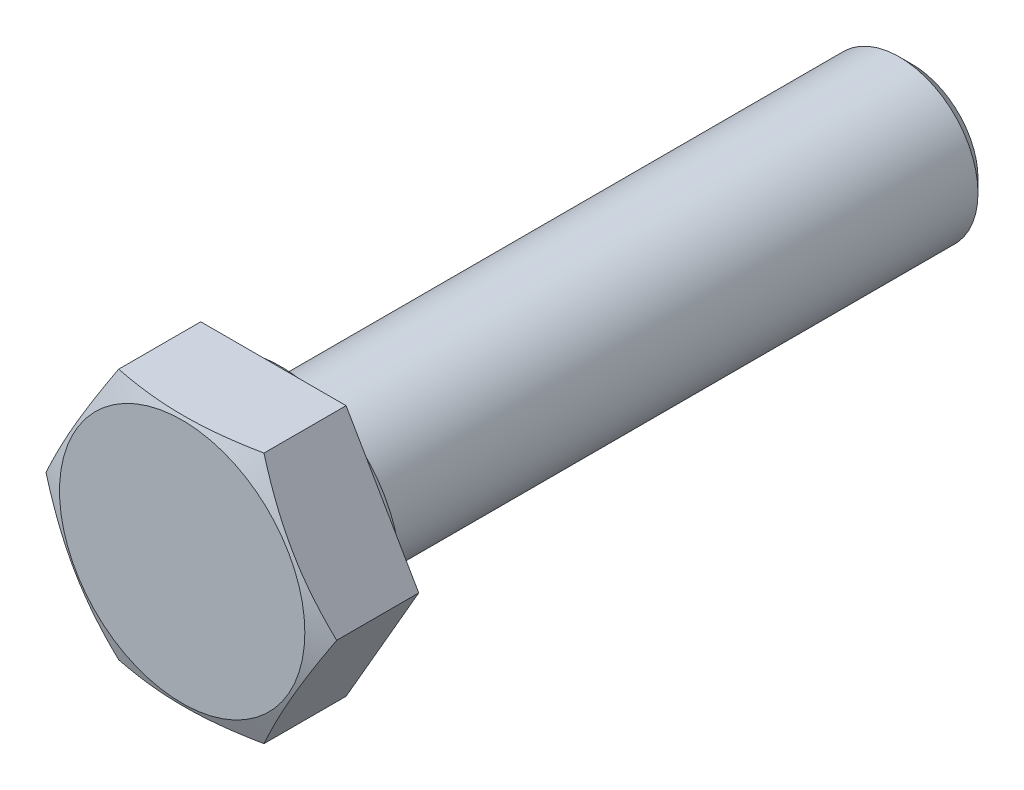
ISO-10303-21;
HEADER;
FILE_DESCRIPTION(('STEP AP214'),'2;1');
FILE_NAME('part.step','',(''),(''),'','','');
FILE_SCHEMA(('AUTOMOTIVE_DESIGN { 1 0 10303 214 1 1 1 1 }'));
ENDSEC;
DATA;
#1=APPLICATION_CONTEXT('core data for automotive mechanical design processes');
#2=APPLICATION_PROTOCOL_DEFINITION('international standard','automotive_design',2000,#1);
#3=PRODUCT_CONTEXT('',#1,'mechanical');
#4=PRODUCT('Part','Part','',(#3));
#5=PRODUCT_RELATED_PRODUCT_CATEGORY('part','',(#4));
#6=PRODUCT_DEFINITION_FORMATION('','',#4);
#7=PRODUCT_DEFINITION_CONTEXT('part definition',#1,'design');
#8=PRODUCT_DEFINITION('design','',#6,#7);
#9=PRODUCT_DEFINITION_SHAPE('','',#8);
#10=(LENGTH_UNIT() NAMED_UNIT(*) SI_UNIT(.MILLI.,.METRE.));
#11=(NAMED_UNIT(*) PLANE_ANGLE_UNIT() SI_UNIT($,.RADIAN.));
#12=(NAMED_UNIT(*) SI_UNIT($,.STERADIAN.) SOLID_ANGLE_UNIT());
#13=UNCERTAINTY_MEASURE_WITH_UNIT(LENGTH_MEASURE(1.E-05),#10,'distance_accuracy_value','');
#14=(GEOMETRIC_REPRESENTATION_CONTEXT(3) GLOBAL_UNCERTAINTY_ASSIGNED_CONTEXT((#13)) GLOBAL_UNIT_ASSIGNED_CONTEXT((#10,
#11,#12)) REPRESENTATION_CONTEXT('',''));
#15=CARTESIAN_POINT('',(0.,0.,0.));
#16=DIRECTION('',(0.,0.,1.));
#17=DIRECTION('',(1.,0.,0.));
#18=AXIS2_PLACEMENT_3D('',#15,#16,#17);
#19=CARTESIAN_POINT('',(0.,7.835,0.6));
#20=DIRECTION('',(0.,0.,1.));
#21=DIRECTION('',(1.,0.,0.));
#22=AXIS2_PLACEMENT_3D('',#19,#20,#21);
#23=PLANE('',#22);
#24=CARTESIAN_POINT('',(0.,0.,0.6));
#25=DIRECTION('',(0.,0.,1.));
#26=DIRECTION('',(1.,0.,0.));
#27=AXIS2_PLACEMENT_3D('',#24,#25,#26);
#28=CIRCLE('',#27,7.835);
#29=CARTESIAN_POINT('',(7.835,0.,0.6));
#30=VERTEX_POINT('',#29);
#31=EDGE_CURVE('E229',#30,#30,#28,.T.);
#32=ORIENTED_EDGE('',*,*,#31,.T.);
#33=EDGE_LOOP('',(#32));
#34=FACE_BOUND('',#33,.T.);
#35=DIRECTION('',(-1.,0.,0.));
#36=VECTOR('',#35,1.);
#37=CARTESIAN_POINT('',(0.,-7.99999626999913,0.6));
#38=LINE('',#37,#36);
#39=CARTESIAN_POINT('',(4.6188,-7.99999626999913,0.6));
#40=VERTEX_POINT('',#39);
#41=CARTESIAN_POINT('',(-4.6188,-7.99999626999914,0.6));
#42=VERTEX_POINT('',#41);
#43=EDGE_CURVE('E215',#40,#42,#38,.T.);
#44=ORIENTED_EDGE('',*,*,#43,.T.);
#45=DIRECTION('',(-0.5,0.866025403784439,0.));
#46=VECTOR('',#45,1.);
#47=CARTESIAN_POINT('',(-10.3208545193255,1.87625186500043,0.6));
#48=LINE('',#47,#46);
#49=CARTESIAN_POINT('',(-9.2376,0.,0.6));
#50=VERTEX_POINT('',#49);
#51=EDGE_CURVE('E84',#42,#50,#48,.T.);
#52=ORIENTED_EDGE('',*,*,#51,.T.);
#53=DIRECTION('',(0.5,0.866025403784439,0.));
#54=VECTOR('',#53,1.);
#55=CARTESIAN_POINT('',(-3.53554548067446,9.87624813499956,0.6));
#56=LINE('',#55,#54);
#57=CARTESIAN_POINT('',(-4.6188,7.99999626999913,0.6));
#58=VERTEX_POINT('',#57);
#59=EDGE_CURVE('E223',#50,#58,#56,.T.);
#60=ORIENTED_EDGE('',*,*,#59,.T.);
#61=DIRECTION('',(1.,0.,0.));
#62=VECTOR('',#61,1.);
#63=CARTESIAN_POINT('',(0.,7.99999626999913,0.6));
#64=LINE('',#63,#62);
#65=CARTESIAN_POINT('',(4.6188,7.99999626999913,0.6));
#66=VERTEX_POINT('',#65);
#67=EDGE_CURVE('E220',#58,#66,#64,.T.);
#68=ORIENTED_EDGE('',*,*,#67,.T.);
#69=DIRECTION('',(0.5,-0.866025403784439,0.));
#70=VECTOR('',#69,1.);
#71=CARTESIAN_POINT('',(3.53554548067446,9.87624813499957,0.6));
#72=LINE('',#71,#70);
#73=CARTESIAN_POINT('',(9.2376,0.,0.6));
#74=VERTEX_POINT('',#73);
#75=EDGE_CURVE('E218',#66,#74,#72,.T.);
#76=ORIENTED_EDGE('',*,*,#75,.T.);
#77=DIRECTION('',(-0.5,-0.866025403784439,0.));
#78=VECTOR('',#77,1.);
#79=CARTESIAN_POINT('',(10.3208545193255,1.87625186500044,0.6));
#80=LINE('',#79,#78);
#81=EDGE_CURVE('E203',#74,#40,#80,.T.);
#82=ORIENTED_EDGE('',*,*,#81,.T.);
#83=EDGE_LOOP('',(#44,#52,#60,#68,#76,#82));
#84=FACE_BOUND('',#83,.T.);
#85=ADVANCED_FACE('F17',(#34,#84),#23,.F.);
#86=CARTESIAN_POINT('',(0.,0.,-40.));
#87=DIRECTION('',(0.,0.,1.));
#88=DIRECTION('',(1.,0.,0.));
#89=AXIS2_PLACEMENT_3D('',#86,#87,#88);
#90=PLANE('',#89);
#91=CARTESIAN_POINT('',(0.,0.,-40.));
#92=DIRECTION('',(0.,0.,1.));
#93=DIRECTION('',(1.,0.,0.));
#94=AXIS2_PLACEMENT_3D('',#91,#92,#93);
#95=CIRCLE('',#94,4.188125);
#96=CARTESIAN_POINT('',(4.188125,0.,-40.));
#97=VERTEX_POINT('',#96);
#98=EDGE_CURVE('E77',#97,#97,#95,.T.);
#99=ORIENTED_EDGE('',*,*,#98,.F.);
#100=EDGE_LOOP('',(#99));
#101=FACE_BOUND('',#100,.T.);
#102=ADVANCED_FACE('F19',(#101),#90,.F.);
#103=CARTESIAN_POINT('',(0.,0.,-40.));
#104=DIRECTION('',(0.,0.,1.));
#105=DIRECTION('',(1.,0.,0.));
#106=AXIS2_PLACEMENT_3D('',#103,#104,#105);
#107=CONICAL_SURFACE('',#106,4.188125,0.785398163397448);
#108=CARTESIAN_POINT('',(0.,0.,-39.188125));
#109=DIRECTION('',(0.,0.,1.));
#110=DIRECTION('',(1.,0.,0.));
#111=AXIS2_PLACEMENT_3D('',#108,#109,#110);
#112=CIRCLE('',#111,5.);
#113=CARTESIAN_POINT('',(5.,0.,-39.188125));
#114=VERTEX_POINT('',#113);
#115=EDGE_CURVE('E173',#114,#114,#112,.T.);
#116=ORIENTED_EDGE('',*,*,#115,.F.);
#117=EDGE_LOOP('',(#116));
#118=FACE_BOUND('',#117,.T.);
#119=ORIENTED_EDGE('',*,*,#98,.T.);
#120=EDGE_LOOP('',(#119));
#121=FACE_BOUND('',#120,.T.);
#122=ADVANCED_FACE('F135',(#118,#121),#107,.T.);
#123=CARTESIAN_POINT('',(0.,0.,6.4));
#124=DIRECTION('',(0.,0.,1.));
#125=DIRECTION('',(1.,0.,0.));
#126=AXIS2_PLACEMENT_3D('',#123,#124,#125);
#127=CYLINDRICAL_SURFACE('',#126,5.);
#128=CARTESIAN_POINT('',(0.,0.,-1.5));
#129=DIRECTION('',(0.,0.,1.));
#130=DIRECTION('',(1.,0.,0.));
#131=AXIS2_PLACEMENT_3D('',#128,#129,#130);
#132=CIRCLE('',#131,5.);
#133=CARTESIAN_POINT('',(5.,0.,-1.5));
#134=VERTEX_POINT('',#133);
#135=EDGE_CURVE('E177',#134,#134,#132,.T.);
#136=ORIENTED_EDGE('',*,*,#135,.F.);
#137=EDGE_LOOP('',(#136));
#138=FACE_BOUND('',#137,.T.);
#139=ORIENTED_EDGE('',*,*,#115,.T.);
#140=EDGE_LOOP('',(#139));
#141=FACE_BOUND('',#140,.T.);
#142=ADVANCED_FACE('F162',(#138,#141),#127,.T.);
#143=CARTESIAN_POINT('',(0.,5.,-1.5));
#144=DIRECTION('',(0.,0.,-1.));
#145=DIRECTION('',(-1.,0.,0.));
#146=AXIS2_PLACEMENT_3D('',#143,#144,#145);
#147=PLANE('',#146);
#148=CARTESIAN_POINT('',(0.,0.,-1.5));
#149=DIRECTION('',(0.,0.,1.));
#150=DIRECTION('',(1.,0.,0.));
#151=AXIS2_PLACEMENT_3D('',#148,#149,#150);
#152=CIRCLE('',#151,4.188125);
#153=CARTESIAN_POINT('',(4.188125,0.,-1.5));
#154=VERTEX_POINT('',#153);
#155=EDGE_CURVE('E243',#154,#154,#152,.T.);
#156=ORIENTED_EDGE('',*,*,#155,.F.);
#157=EDGE_LOOP('',(#156));
#158=FACE_BOUND('',#157,.T.);
#159=ORIENTED_EDGE('',*,*,#135,.T.);
#160=EDGE_LOOP('',(#159));
#161=FACE_BOUND('',#160,.T.);
#162=ADVANCED_FACE('F158',(#158,#161),#147,.F.);
#163=CARTESIAN_POINT('',(0.,0.,-1.5));
#164=DIRECTION('',(0.,0.,1.));
#165=DIRECTION('',(1.,0.,0.));
#166=AXIS2_PLACEMENT_3D('',#163,#164,#165);
#167=CONICAL_SURFACE('',#166,4.188125,1.0471975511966);
#168=CARTESIAN_POINT('',(0.,0.,-1.03126375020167));
#169=DIRECTION('',(0.,0.,1.));
#170=DIRECTION('',(1.,0.,0.));
#171=AXIS2_PLACEMENT_3D('',#168,#169,#170);
#172=CIRCLE('',#171,5.);
#173=CARTESIAN_POINT('',(5.,0.,-1.03126375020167));
#174=VERTEX_POINT('',#173);
#175=EDGE_CURVE('E240',#174,#174,#172,.T.);
#176=ORIENTED_EDGE('',*,*,#175,.F.);
#177=EDGE_LOOP('',(#176));
#178=FACE_BOUND('',#177,.T.);
#179=ORIENTED_EDGE('',*,*,#155,.T.);
#180=EDGE_LOOP('',(#179));
#181=FACE_BOUND('',#180,.T.);
#182=ADVANCED_FACE('F154',(#178,#181),#167,.T.);
#183=CARTESIAN_POINT('',(0.,0.,6.4));
#184=DIRECTION('',(0.,0.,1.));
#185=DIRECTION('',(1.,0.,0.));
#186=AXIS2_PLACEMENT_3D('',#183,#184,#185);
#187=CYLINDRICAL_SURFACE('',#186,5.);
#188=CARTESIAN_POINT('',(0.,0.,-0.5));
#189=DIRECTION('',(0.,0.,1.));
#190=DIRECTION('',(1.,0.,0.));
#191=AXIS2_PLACEMENT_3D('',#188,#189,#190);
#192=CIRCLE('',#191,5.);
#193=CARTESIAN_POINT('',(5.,0.,-0.5));
#194=VERTEX_POINT('',#193);
#195=EDGE_CURVE('E237',#194,#194,#192,.T.);
#196=ORIENTED_EDGE('',*,*,#195,.F.);
#197=EDGE_LOOP('',(#196));
#198=FACE_BOUND('',#197,.T.);
#199=ORIENTED_EDGE('',*,*,#175,.T.);
#200=EDGE_LOOP('',(#199));
#201=FACE_BOUND('',#200,.T.);
#202=ADVANCED_FACE('F150',(#198,#201),#187,.T.);
#203=CARTESIAN_POINT('',(0.,0.,-0.5));
#204=DIRECTION('',(0.,0.,1.));
#205=DIRECTION('',(1.,0.,0.));
#206=AXIS2_PLACEMENT_3D('',#203,#204,#205);
#207=TOROIDAL_SURFACE('',#206,5.5,0.5);
#208=ORIENTED_EDGE('',*,*,#195,.T.);
#209=EDGE_LOOP('',(#208));
#210=FACE_BOUND('',#209,.T.);
#211=CARTESIAN_POINT('',(0.,0.,0.));
#212=DIRECTION('',(0.,0.,1.));
#213=DIRECTION('',(1.,0.,0.));
#214=AXIS2_PLACEMENT_3D('',#211,#212,#213);
#215=CIRCLE('',#214,5.5);
#216=CARTESIAN_POINT('',(5.5,0.,0.));
#217=VERTEX_POINT('',#216);
#218=EDGE_CURVE('E234',#217,#217,#215,.T.);
#219=ORIENTED_EDGE('',*,*,#218,.F.);
#220=EDGE_LOOP('',(#219));
#221=FACE_BOUND('',#220,.T.);
#222=ADVANCED_FACE('F146',(#210,#221),#207,.F.);
#223=CARTESIAN_POINT('',(0.,5.5,0.));
#224=DIRECTION('',(0.,0.,1.));
#225=DIRECTION('',(1.,0.,0.));
#226=AXIS2_PLACEMENT_3D('',#223,#224,#225);
#227=PLANE('',#226);
#228=CARTESIAN_POINT('',(0.,0.,0.));
#229=DIRECTION('',(0.,0.,1.));
#230=DIRECTION('',(1.,0.,0.));
#231=AXIS2_PLACEMENT_3D('',#228,#229,#230);
#232=CIRCLE('',#231,7.235);
#233=CARTESIAN_POINT('',(7.235,0.,0.));
#234=VERTEX_POINT('',#233);
#235=EDGE_CURVE('E231',#234,#234,#232,.T.);
#236=ORIENTED_EDGE('',*,*,#235,.F.);
#237=EDGE_LOOP('',(#236));
#238=FACE_BOUND('',#237,.T.);
#239=ORIENTED_EDGE('',*,*,#218,.T.);
#240=EDGE_LOOP('',(#239));
#241=FACE_BOUND('',#240,.T.);
#242=ADVANCED_FACE('F142',(#238,#241),#227,.F.);
#243=CARTESIAN_POINT('',(0.,0.,0.6));
#244=DIRECTION('',(0.,0.,1.));
#245=DIRECTION('',(1.,0.,0.));
#246=AXIS2_PLACEMENT_3D('',#243,#244,#245);
#247=TOROIDAL_SURFACE('',#246,7.235,0.6);
#248=ORIENTED_EDGE('',*,*,#31,.F.);
#249=EDGE_LOOP('',(#248));
#250=FACE_BOUND('',#249,.T.);
#251=ORIENTED_EDGE('',*,*,#235,.T.);
#252=EDGE_LOOP('',(#251));
#253=FACE_BOUND('',#252,.T.);
#254=ADVANCED_FACE('F117',(#250,#253),#247,.T.);
#255=CARTESIAN_POINT('',(-4.6188,-7.99999626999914,-40.));
#256=DIRECTION('',(0.866025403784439,0.5,0.));
#257=DIRECTION('',(0.5,-0.866025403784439,0.));
#258=AXIS2_PLACEMENT_3D('',#255,#256,#257);
#259=PLANE('',#258);
#260=ORIENTED_EDGE('',*,*,#51,.F.);
#261=DIRECTION('',(0.,0.,1.));
#262=VECTOR('',#261,1.);
#263=CARTESIAN_POINT('',(-4.6188,-7.99999626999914,-40.));
#264=LINE('',#263,#262);
#265=CARTESIAN_POINT('',(-4.6188,-7.99999626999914,5.81818181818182));
#266=VERTEX_POINT('',#265);
#267=EDGE_CURVE('E37',#42,#266,#264,.T.);
#268=ORIENTED_EDGE('',*,*,#267,.T.);
#269=CARTESIAN_POINT('',(-9.23760011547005,2.00000000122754E-07,5.81818177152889));
#270=CARTESIAN_POINT('',(-9.07623171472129,-0.27949806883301,5.88338258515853));
#271=CARTESIAN_POINT('',(-8.91433070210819,-0.559918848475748,5.94367122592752));
#272=CARTESIAN_POINT('',(-8.58945812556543,-1.12261465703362,6.0525711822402));
#273=CARTESIAN_POINT('',(-8.42648599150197,-1.40489067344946,6.10117565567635));
#274=CARTESIAN_POINT('',(-8.09970314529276,-1.97089516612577,6.184761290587));
#275=CARTESIAN_POINT('',(-7.93589269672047,-2.25462318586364,6.21974649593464));
#276=CARTESIAN_POINT('',(-7.60766331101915,-2.82313315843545,6.27447232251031));
#277=CARTESIAN_POINT('',(-7.44324451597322,-3.10791486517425,6.2942163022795));
#278=CARTESIAN_POINT('',(-7.11690996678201,-3.67314288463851,6.31723187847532));
#279=CARTESIAN_POINT('',(-6.95499911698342,-3.95358070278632,6.3207774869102));
#280=CARTESIAN_POINT('',(-6.63127309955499,-4.51429061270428,6.31195075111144));
#281=CARTESIAN_POINT('',(-6.46945794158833,-4.79456268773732,6.29957700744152));
#282=CARTESIAN_POINT('',(-6.14641204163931,-5.35409459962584,6.25957675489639));
#283=CARTESIAN_POINT('',(-5.98518099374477,-5.63335496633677,6.23195993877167));
#284=CARTESIAN_POINT('',(-5.66348869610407,-6.190542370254,6.16281191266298));
#285=CARTESIAN_POINT('',(-5.50302737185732,-6.46846953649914,6.12128207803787));
#286=CARTESIAN_POINT('',(-5.28250881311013,-6.85041888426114,6.05563542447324));
#287=CARTESIAN_POINT('',(-5.22204978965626,-6.95513698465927,6.03674445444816));
#288=CARTESIAN_POINT('',(-5.1012744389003,-7.16432602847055,5.99731748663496));
#289=CARTESIAN_POINT('',(-5.04095809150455,-7.26879700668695,5.9767817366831));
#290=CARTESIAN_POINT('',(-4.920256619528,-7.4778580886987,5.93408711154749));
#291=CARTESIAN_POINT('',(-4.85987196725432,-7.58244737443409,5.91192291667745));
#292=CARTESIAN_POINT('',(-4.73923496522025,-7.79139679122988,5.86612783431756));
#293=CARTESIAN_POINT('',(-4.67898263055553,-7.89575689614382,5.84249678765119));
#294=CARTESIAN_POINT('',(-4.61879988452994,-7.99999646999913,5.81818177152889));
#295=B_SPLINE_CURVE_WITH_KNOTS('',3,(#269,#270,#271,#272,#273,#274,#275,#276,#277,#278,#279,
#280,#281,#282,#283,#284,#285,#286,#287,#288,#289,#290,#291,#292,#293,#294),.UNSPECIFIED.,.F.,
.F.,(4,2,2,2,2,2,2,2,2,2,2,2,4),(0.,0.987840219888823,1.97625750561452,2.96438108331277,
3.95228685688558,4.92341776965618,5.89463405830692,6.86523348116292,7.83573698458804,
8.20288448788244,8.56997677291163,8.93832669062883,9.3067166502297),.UNSPECIFIED.);
#296=CARTESIAN_POINT('',(-9.2376,0.,5.81818181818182));
#297=VERTEX_POINT('',#296);
#298=EDGE_CURVE('E11',#297,#266,#295,.T.);
#299=ORIENTED_EDGE('',*,*,#298,.F.);
#300=DIRECTION('',(0.,0.,1.));
#301=VECTOR('',#300,1.);
#302=CARTESIAN_POINT('',(-9.2376,0.,-40.));
#303=LINE('',#302,#301);
#304=EDGE_CURVE('E213',#50,#297,#303,.T.);
#305=ORIENTED_EDGE('',*,*,#304,.F.);
#306=EDGE_LOOP('',(#260,#268,#299,#305));
#307=FACE_BOUND('',#306,.T.);
#308=ADVANCED_FACE('F80',(#307),#259,.F.);
#309=CARTESIAN_POINT('',(-9.2376,0.,-40.));
#310=DIRECTION('',(0.866025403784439,-0.5,0.));
#311=DIRECTION('',(-0.5,-0.866025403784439,0.));
#312=AXIS2_PLACEMENT_3D('',#309,#310,#311);
#313=PLANE('',#312);
#314=ORIENTED_EDGE('',*,*,#59,.F.);
#315=ORIENTED_EDGE('',*,*,#304,.T.);
#316=CARTESIAN_POINT('',(-4.61879988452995,7.99999646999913,5.81818177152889));
#317=CARTESIAN_POINT('',(-4.78016828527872,7.72049820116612,5.88338258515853));
#318=CARTESIAN_POINT('',(-4.94206929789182,7.44007742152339,5.94367122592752));
#319=CARTESIAN_POINT('',(-5.26694187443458,6.87738161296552,6.0525711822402));
#320=CARTESIAN_POINT('',(-5.42991400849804,6.59510559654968,6.10117565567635));
#321=CARTESIAN_POINT('',(-5.75669685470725,6.02910110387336,6.184761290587));
#322=CARTESIAN_POINT('',(-5.92050730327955,5.7453730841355,6.21974649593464));
#323=CARTESIAN_POINT('',(-6.24873668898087,5.17686311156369,6.27447232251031));
#324=CARTESIAN_POINT('',(-6.41315548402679,4.89208140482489,6.2942163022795));
#325=CARTESIAN_POINT('',(-6.739490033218,4.32685338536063,6.31723187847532));
#326=CARTESIAN_POINT('',(-6.90140088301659,4.04641556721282,6.3207774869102));
#327=CARTESIAN_POINT('',(-7.22512690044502,3.48570565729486,6.31195075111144));
#328=CARTESIAN_POINT('',(-7.38694205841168,3.20543358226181,6.29957700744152));
#329=CARTESIAN_POINT('',(-7.7099879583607,2.6459016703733,6.25957675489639));
#330=CARTESIAN_POINT('',(-7.87121900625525,2.36664130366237,6.23195993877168));
#331=CARTESIAN_POINT('',(-8.19291130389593,1.80945389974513,6.16281191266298));
#332=CARTESIAN_POINT('',(-8.35337262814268,1.53152673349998,6.12128207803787));
#333=CARTESIAN_POINT('',(-8.57389118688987,1.14957738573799,6.05563542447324));
#334=CARTESIAN_POINT('',(-8.63435021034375,1.04485928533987,6.03674445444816));
#335=CARTESIAN_POINT('',(-8.75512556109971,0.835670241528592,5.99731748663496));
#336=CARTESIAN_POINT('',(-8.81544190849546,0.731199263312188,5.97678173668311));
#337=CARTESIAN_POINT('',(-8.93614338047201,0.522138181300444,5.93408711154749));
#338=CARTESIAN_POINT('',(-8.99652803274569,0.417548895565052,5.91192291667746));
#339=CARTESIAN_POINT('',(-9.11716503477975,0.208599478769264,5.86612783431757));
#340=CARTESIAN_POINT('',(-9.17741736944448,0.104239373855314,5.84249678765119));
#341=CARTESIAN_POINT('',(-9.23760011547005,-2.0000000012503E-07,5.81818177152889));
#342=B_SPLINE_CURVE_WITH_KNOTS('',3,(#316,#317,#318,#319,#320,#321,#322,#323,#324,#325,#326,
#327,#328,#329,#330,#331,#332,#333,#334,#335,#336,#337,#338,#339,#340,#341),.UNSPECIFIED.,.F.,
.F.,(4,2,2,2,2,2,2,2,2,2,2,2,4),(0.,0.987840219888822,1.97625750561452,2.96438108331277,
3.95228685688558,4.92341776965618,5.89463405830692,6.86523348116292,7.83573698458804,
8.20288448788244,8.56997677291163,8.93832669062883,9.3067166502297),.UNSPECIFIED.);
#343=CARTESIAN_POINT('',(-4.6188,7.99999626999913,5.81818181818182));
#344=VERTEX_POINT('',#343);
#345=EDGE_CURVE('E30',#344,#297,#342,.T.);
#346=ORIENTED_EDGE('',*,*,#345,.F.);
#347=DIRECTION('',(0.,0.,1.));
#348=VECTOR('',#347,1.);
#349=CARTESIAN_POINT('',(-4.6188,7.99999626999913,-40.));
#350=LINE('',#349,#348);
#351=EDGE_CURVE('E208',#58,#344,#350,.T.);
#352=ORIENTED_EDGE('',*,*,#351,.F.);
#353=EDGE_LOOP('',(#314,#315,#346,#352));
#354=FACE_BOUND('',#353,.T.);
#355=ADVANCED_FACE('F109',(#354),#313,.F.);
#356=CARTESIAN_POINT('',(-4.6188,7.99999626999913,-40.));
#357=DIRECTION('',(0.,-1.,0.));
#358=DIRECTION('',(-1.,0.,0.));
#359=AXIS2_PLACEMENT_3D('',#356,#357,#358);
#360=PLANE('',#359);
#361=ORIENTED_EDGE('',*,*,#67,.F.);
#362=ORIENTED_EDGE('',*,*,#351,.T.);
#363=CARTESIAN_POINT('',(-12.5719547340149,7.99999626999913,3.52982738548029));
#364=CARTESIAN_POINT('',(-12.1983187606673,7.99999626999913,3.65714990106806));
#365=CARTESIAN_POINT('',(-11.8241969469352,7.99999626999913,3.78307295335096));
#366=CARTESIAN_POINT('',(-11.0747197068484,7.99999626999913,4.03131289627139));
#367=CARTESIAN_POINT('',(-10.6993641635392,7.99999626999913,4.15362943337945));
#368=CARTESIAN_POINT('',(-9.94620503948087,7.99999626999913,4.39415137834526));
#369=CARTESIAN_POINT('',(-9.56839757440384,7.99999626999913,4.51234466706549));
#370=CARTESIAN_POINT('',(-8.81107863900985,7.99999626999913,4.74312776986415));
#371=CARTESIAN_POINT('',(-8.43156721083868,7.99999626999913,4.85571772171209));
#372=CARTESIAN_POINT('',(-7.67246142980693,7.99999626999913,5.07327543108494));
#373=CARTESIAN_POINT('',(-7.29287748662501,7.99999626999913,5.17827932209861));
#374=CARTESIAN_POINT('',(-6.53133965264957,7.99999626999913,5.37943691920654));
#375=CARTESIAN_POINT('',(-6.14938567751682,7.99999626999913,5.47559030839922));
#376=CARTESIAN_POINT('',(-5.38308686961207,7.99999626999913,5.65661961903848));
#377=CARTESIAN_POINT('',(-4.99874399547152,7.99999626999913,5.74150375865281));
#378=CARTESIAN_POINT('',(-4.22720948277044,7.99999626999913,5.89721151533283));
#379=CARTESIAN_POINT('',(-3.84001810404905,7.99999626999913,5.96803639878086));
#380=CARTESIAN_POINT('',(-3.15468340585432,7.99999626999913,6.07772100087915));
#381=CARTESIAN_POINT('',(-2.85711851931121,7.99999626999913,6.12017938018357));
#382=CARTESIAN_POINT('',(-2.26056309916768,7.99999626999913,6.19360511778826));
#383=CARTESIAN_POINT('',(-1.9615726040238,7.99999626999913,6.22457278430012));
#384=CARTESIAN_POINT('',(-1.36269467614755,7.99999626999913,6.27378877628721));
#385=CARTESIAN_POINT('',(-1.06280781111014,7.99999626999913,6.29204392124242));
#386=CARTESIAN_POINT('',(-0.462511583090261,7.99999626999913,6.31505964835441));
#387=CARTESIAN_POINT('',(-0.162102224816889,7.99999626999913,6.31982035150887));
#388=CARTESIAN_POINT('',(0.43871841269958,7.99999626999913,6.31562600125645));
#389=CARTESIAN_POINT('',(0.739129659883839,7.99999626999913,6.30666642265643));
#390=CARTESIAN_POINT('',(1.33925291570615,7.99999626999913,6.27543464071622));
#391=CARTESIAN_POINT('',(1.63896491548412,7.99999626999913,6.25316226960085));
#392=CARTESIAN_POINT('',(2.23737206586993,7.99999626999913,6.19623962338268));
#393=CARTESIAN_POINT('',(2.53606652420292,7.99999626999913,6.16158216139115));
#394=CARTESIAN_POINT('',(3.13194924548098,7.99999626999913,6.08119272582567));
#395=CARTESIAN_POINT('',(3.42913747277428,7.99999626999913,6.03546049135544));
#396=CARTESIAN_POINT('',(4.11363187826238,7.99999626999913,5.91871471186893));
#397=CARTESIAN_POINT('',(4.50034816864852,7.99999626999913,5.84425774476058));
#398=CARTESIAN_POINT('',(5.27095740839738,7.99999626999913,5.68198807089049));
#399=CARTESIAN_POINT('',(5.65485012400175,7.99999626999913,5.59417427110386));
#400=CARTESIAN_POINT('',(6.42025470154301,7.99999626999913,5.40788960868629));
#401=CARTESIAN_POINT('',(6.80176506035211,7.99999626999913,5.30941262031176));
#402=CARTESIAN_POINT('',(7.56249587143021,7.99999626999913,5.10408437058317));
#403=CARTESIAN_POINT('',(7.94171640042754,7.99999626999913,4.99723339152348));
#404=CARTESIAN_POINT('',(8.69926332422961,7.99999626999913,4.77660865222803));
#405=CARTESIAN_POINT('',(9.07758437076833,7.99999626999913,4.66281661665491));
#406=CARTESIAN_POINT('',(9.83259783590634,7.99999626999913,4.42994140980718));
#407=CARTESIAN_POINT('',(10.2092902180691,7.99999626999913,4.31085812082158));
#408=CARTESIAN_POINT('',(10.9604179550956,7.99999626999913,4.06875367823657));
#409=CARTESIAN_POINT('',(11.3348565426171,7.99999626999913,3.94574252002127));
#410=CARTESIAN_POINT('',(12.0825558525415,7.99999626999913,3.69629462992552));
#411=CARTESIAN_POINT('',(12.4558166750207,7.99999626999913,3.56985819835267));
#412=CARTESIAN_POINT('',(12.8286123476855,7.99999626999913,3.44208796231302));
#413=B_SPLINE_CURVE_WITH_KNOTS('',3,(#363,#364,#365,#366,#367,#368,#369,#370,#371,#372,#373,
#374,#375,#376,#377,#378,#379,#380,#381,#382,#383,#384,#385,#386,#387,#388,#389,#390,#391,#392,
#393,#394,#395,#396,#397,#398,#399,#400,#401,#402,#403,#404,#405,#406,#407,#408,#409,#410,#411,
#412),.UNSPECIFIED.,.F.,.F.,(4,2,2,2,2,2,2,2,2,2,2,2,2,2,2,2,2,2,2,2,2,2,2,2,4),(0.,
1.18421166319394,2.36853902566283,3.55609567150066,4.74362310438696,5.92505950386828,
7.10653818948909,8.28715048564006,9.46765639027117,10.3692009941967,11.2707214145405,
12.1717578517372,13.0727862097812,13.9741118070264,14.8754487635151,15.777309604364,
16.6791916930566,17.8603375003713,19.0415800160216,20.2235047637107,21.4053896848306,
22.5905333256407,23.7757033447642,24.9580661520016,26.1403256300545),.UNSPECIFIED.);
#414=CARTESIAN_POINT('',(4.6188,7.99999626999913,5.81818181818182));
#415=VERTEX_POINT('',#414);
#416=EDGE_CURVE('E91',#415,#344,#413,.F.);
#417=ORIENTED_EDGE('',*,*,#416,.F.);
#418=DIRECTION('',(0.,0.,1.));
#419=VECTOR('',#418,1.);
#420=CARTESIAN_POINT('',(4.6188,7.99999626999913,-40.));
#421=LINE('',#420,#419);
#422=EDGE_CURVE('E205',#66,#415,#421,.T.);
#423=ORIENTED_EDGE('',*,*,#422,.F.);
#424=EDGE_LOOP('',(#361,#362,#417,#423));
#425=FACE_BOUND('',#424,.T.);
#426=ADVANCED_FACE('F112',(#425),#360,.F.);
#427=CARTESIAN_POINT('',(4.6188,7.99999626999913,-40.));
#428=DIRECTION('',(-0.866025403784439,-0.5,0.));
#429=DIRECTION('',(-0.5,0.866025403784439,0.));
#430=AXIS2_PLACEMENT_3D('',#427,#428,#429);
#431=PLANE('',#430);
#432=ORIENTED_EDGE('',*,*,#75,.F.);
#433=ORIENTED_EDGE('',*,*,#422,.T.);
#434=CARTESIAN_POINT('',(9.23760011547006,-2.00000002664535E-07,5.81818177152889));
#435=CARTESIAN_POINT('',(9.07623171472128,0.279498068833,5.88338258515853));
#436=CARTESIAN_POINT('',(8.91433070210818,0.559918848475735,5.94367122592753));
#437=CARTESIAN_POINT('',(8.58945812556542,1.12261465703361,6.0525711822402));
#438=CARTESIAN_POINT('',(8.42648599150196,1.40489067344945,6.10117565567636));
#439=CARTESIAN_POINT('',(8.09970314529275,1.97089516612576,6.18476129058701));
#440=CARTESIAN_POINT('',(7.93589269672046,2.25462318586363,6.21974649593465));
#441=CARTESIAN_POINT('',(7.60766331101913,2.82313315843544,6.27447232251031));
#442=CARTESIAN_POINT('',(7.44324451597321,3.10791486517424,6.29421630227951));
#443=CARTESIAN_POINT('',(7.116909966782,3.6731428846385,6.31723187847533));
#444=CARTESIAN_POINT('',(6.95499911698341,3.95358070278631,6.3207774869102));
#445=CARTESIAN_POINT('',(6.63127309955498,4.51429061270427,6.31195075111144));
#446=CARTESIAN_POINT('',(6.46945794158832,4.79456268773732,6.29957700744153));
#447=CARTESIAN_POINT('',(6.1464120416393,5.35409459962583,6.25957675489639));
#448=CARTESIAN_POINT('',(5.98518099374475,5.63335496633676,6.23195993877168));
#449=CARTESIAN_POINT('',(5.66348869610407,6.190542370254,6.16281191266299));
#450=CARTESIAN_POINT('',(5.50302737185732,6.46846953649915,6.12128207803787));
#451=CARTESIAN_POINT('',(5.28250881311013,6.85041888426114,6.05563542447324));
#452=CARTESIAN_POINT('',(5.22204978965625,6.95513698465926,6.03674445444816));
#453=CARTESIAN_POINT('',(5.10127443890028,7.16432602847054,5.99731748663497));
#454=CARTESIAN_POINT('',(5.04095809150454,7.26879700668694,5.97678173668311));
#455=CARTESIAN_POINT('',(4.92025661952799,7.47785808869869,5.93408711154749));
#456=CARTESIAN_POINT('',(4.85987196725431,7.58244737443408,5.91192291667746));
#457=CARTESIAN_POINT('',(4.73923496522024,7.79139679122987,5.86612783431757));
#458=CARTESIAN_POINT('',(4.67898263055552,7.89575689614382,5.8424967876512));
#459=CARTESIAN_POINT('',(4.61879988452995,7.99999646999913,5.81818177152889));
#460=B_SPLINE_CURVE_WITH_KNOTS('',3,(#434,#435,#436,#437,#438,#439,#440,#441,#442,#443,#444,
#445,#446,#447,#448,#449,#450,#451,#452,#453,#454,#455,#456,#457,#458,#459),.UNSPECIFIED.,.F.,
.F.,(4,2,2,2,2,2,2,2,2,2,2,2,4),(0.,0.987840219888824,1.97625750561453,2.96438108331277,
3.95228685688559,4.92341776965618,5.89463405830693,6.86523348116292,7.83573698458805,
8.20288448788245,8.56997677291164,8.93832669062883,9.30671665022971),.UNSPECIFIED.);
#461=CARTESIAN_POINT('',(9.2376,0.,5.81818181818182));
#462=VERTEX_POINT('',#461);
#463=EDGE_CURVE('E95',#462,#415,#460,.T.);
#464=ORIENTED_EDGE('',*,*,#463,.F.);
#465=DIRECTION('',(0.,0.,1.));
#466=VECTOR('',#465,1.);
#467=CARTESIAN_POINT('',(9.2376,0.,-40.));
#468=LINE('',#467,#466);
#469=EDGE_CURVE('E202',#74,#462,#468,.T.);
#470=ORIENTED_EDGE('',*,*,#469,.F.);
#471=EDGE_LOOP('',(#432,#433,#464,#470));
#472=FACE_BOUND('',#471,.T.);
#473=ADVANCED_FACE('F191',(#472),#431,.F.);
#474=CARTESIAN_POINT('',(9.2376,0.,-40.));
#475=DIRECTION('',(-0.866025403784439,0.5,0.));
#476=DIRECTION('',(0.5,0.866025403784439,0.));
#477=AXIS2_PLACEMENT_3D('',#474,#475,#476);
#478=PLANE('',#477);
#479=ORIENTED_EDGE('',*,*,#81,.F.);
#480=ORIENTED_EDGE('',*,*,#469,.T.);
#481=CARTESIAN_POINT('',(4.61879988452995,-7.99999646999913,5.81818177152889));
#482=CARTESIAN_POINT('',(4.78016828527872,-7.72049820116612,5.88338258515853));
#483=CARTESIAN_POINT('',(4.94206929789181,-7.44007742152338,5.94367122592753));
#484=CARTESIAN_POINT('',(5.26694187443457,-6.87738161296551,6.0525711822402));
#485=CARTESIAN_POINT('',(5.42991400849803,-6.59510559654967,6.10117565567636));
#486=CARTESIAN_POINT('',(5.75669685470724,-6.02910110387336,6.18476129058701));
#487=CARTESIAN_POINT('',(5.92050730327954,-5.74537308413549,6.21974649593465));
#488=CARTESIAN_POINT('',(6.24873668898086,-5.17686311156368,6.27447232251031));
#489=CARTESIAN_POINT('',(6.41315548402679,-4.89208140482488,6.29421630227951));
#490=CARTESIAN_POINT('',(6.739490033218,-4.32685338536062,6.31723187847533));
#491=CARTESIAN_POINT('',(6.90140088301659,-4.04641556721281,6.3207774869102));
#492=CARTESIAN_POINT('',(7.22512690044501,-3.48570565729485,6.31195075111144));
#493=CARTESIAN_POINT('',(7.38694205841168,-3.2054335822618,6.29957700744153));
#494=CARTESIAN_POINT('',(7.70998795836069,-2.64590167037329,6.25957675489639));
#495=CARTESIAN_POINT('',(7.87121900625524,-2.36664130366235,6.23195993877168));
#496=CARTESIAN_POINT('',(8.19291130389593,-1.80945389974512,6.16281191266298));
#497=CARTESIAN_POINT('',(8.35337262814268,-1.53152673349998,6.12128207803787));
#498=CARTESIAN_POINT('',(8.57389118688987,-1.14957738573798,6.05563542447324));
#499=CARTESIAN_POINT('',(8.63435021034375,-1.04485928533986,6.03674445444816));
#500=CARTESIAN_POINT('',(8.7551255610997,-0.835670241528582,5.99731748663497));
#501=CARTESIAN_POINT('',(8.81544190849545,-0.73119926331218,5.97678173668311));
#502=CARTESIAN_POINT('',(8.93614338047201,-0.522138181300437,5.93408711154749));
#503=CARTESIAN_POINT('',(8.99652803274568,-0.417548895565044,5.91192291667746));
#504=CARTESIAN_POINT('',(9.11716503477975,-0.208599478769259,5.86612783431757));
#505=CARTESIAN_POINT('',(9.17741736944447,-0.104239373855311,5.8424967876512));
#506=CARTESIAN_POINT('',(9.23760011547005,1.99999998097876E-07,5.81818177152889));
#507=B_SPLINE_CURVE_WITH_KNOTS('',3,(#481,#482,#483,#484,#485,#486,#487,#488,#489,#490,#491,
#492,#493,#494,#495,#496,#497,#498,#499,#500,#501,#502,#503,#504,#505,#506),.UNSPECIFIED.,.F.,
.F.,(4,2,2,2,2,2,2,2,2,2,2,2,4),(0.,0.987840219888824,1.97625750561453,2.96438108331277,
3.95228685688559,4.92341776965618,5.89463405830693,6.86523348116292,7.83573698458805,
8.20288448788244,8.56997677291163,8.93832669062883,9.3067166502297),.UNSPECIFIED.);
#508=CARTESIAN_POINT('',(4.6188,-7.99999626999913,5.81818181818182));
#509=VERTEX_POINT('',#508);
#510=EDGE_CURVE('E76',#509,#462,#507,.T.);
#511=ORIENTED_EDGE('',*,*,#510,.F.);
#512=DIRECTION('',(0.,0.,1.));
#513=VECTOR('',#512,1.);
#514=CARTESIAN_POINT('',(4.6188,-7.99999626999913,-40.));
#515=LINE('',#514,#513);
#516=EDGE_CURVE('E42',#40,#509,#515,.T.);
#517=ORIENTED_EDGE('',*,*,#516,.F.);
#518=EDGE_LOOP('',(#479,#480,#511,#517));
#519=FACE_BOUND('',#518,.T.);
#520=ADVANCED_FACE('F127',(#519),#478,.F.);
#521=CARTESIAN_POINT('',(4.6188,-7.99999626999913,-40.));
#522=DIRECTION('',(0.,1.,0.));
#523=DIRECTION('',(1.,0.,0.));
#524=AXIS2_PLACEMENT_3D('',#521,#522,#523);
#525=PLANE('',#524);
#526=ORIENTED_EDGE('',*,*,#43,.F.);
#527=ORIENTED_EDGE('',*,*,#516,.T.);
#528=CARTESIAN_POINT('',(-12.5719547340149,-7.99999626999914,3.52982738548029));
#529=CARTESIAN_POINT('',(-12.1983187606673,-7.99999626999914,3.65714990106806));
#530=CARTESIAN_POINT('',(-11.8241969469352,-7.99999626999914,3.78307295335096));
#531=CARTESIAN_POINT('',(-11.0747197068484,-7.99999626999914,4.03131289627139));
#532=CARTESIAN_POINT('',(-10.6993641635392,-7.99999626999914,4.15362943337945));
#533=CARTESIAN_POINT('',(-9.94620503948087,-7.99999626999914,4.39415137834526));
#534=CARTESIAN_POINT('',(-9.56839757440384,-7.99999626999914,4.51234466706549));
#535=CARTESIAN_POINT('',(-8.81107863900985,-7.99999626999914,4.74312776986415));
#536=CARTESIAN_POINT('',(-8.43156721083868,-7.99999626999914,4.85571772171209));
#537=CARTESIAN_POINT('',(-7.67246142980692,-7.99999626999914,5.07327543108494));
#538=CARTESIAN_POINT('',(-7.29287748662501,-7.99999626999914,5.17827932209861));
#539=CARTESIAN_POINT('',(-6.53133965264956,-7.99999626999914,5.37943691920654));
#540=CARTESIAN_POINT('',(-6.14938567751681,-7.99999626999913,5.47559030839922));
#541=CARTESIAN_POINT('',(-5.38308686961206,-7.99999626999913,5.65661961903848));
#542=CARTESIAN_POINT('',(-4.99874399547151,-7.99999626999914,5.7415037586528));
#543=CARTESIAN_POINT('',(-4.22720948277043,-7.99999626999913,5.89721151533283));
#544=CARTESIAN_POINT('',(-3.84001810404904,-7.99999626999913,5.96803639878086));
#545=CARTESIAN_POINT('',(-3.15468340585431,-7.99999626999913,6.07772100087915));
#546=CARTESIAN_POINT('',(-2.8571185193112,-7.99999626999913,6.12017938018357));
#547=CARTESIAN_POINT('',(-2.26056309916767,-7.99999626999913,6.19360511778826));
#548=CARTESIAN_POINT('',(-1.96157260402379,-7.99999626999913,6.22457278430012));
#549=CARTESIAN_POINT('',(-1.36269467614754,-7.99999626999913,6.27378877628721));
#550=CARTESIAN_POINT('',(-1.06280781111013,-7.99999626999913,6.29204392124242));
#551=CARTESIAN_POINT('',(-0.462511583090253,-7.99999626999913,6.31505964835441));
#552=CARTESIAN_POINT('',(-0.16210222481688,-7.99999626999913,6.31982035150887));
#553=CARTESIAN_POINT('',(0.438718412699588,-7.99999626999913,6.31562600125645));
#554=CARTESIAN_POINT('',(0.739129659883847,-7.99999626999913,6.30666642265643));
#555=CARTESIAN_POINT('',(1.33925291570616,-7.99999626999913,6.27543464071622));
#556=CARTESIAN_POINT('',(1.63896491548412,-7.99999626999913,6.25316226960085));
#557=CARTESIAN_POINT('',(2.23737206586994,-7.99999626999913,6.19623962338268));
#558=CARTESIAN_POINT('',(2.53606652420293,-7.99999626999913,6.16158216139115));
#559=CARTESIAN_POINT('',(3.13194924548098,-7.99999626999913,6.08119272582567));
#560=CARTESIAN_POINT('',(3.42913747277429,-7.99999626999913,6.03546049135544));
#561=CARTESIAN_POINT('',(4.11363187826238,-7.99999626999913,5.91871471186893));
#562=CARTESIAN_POINT('',(4.50034816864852,-7.99999626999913,5.84425774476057));
#563=CARTESIAN_POINT('',(5.27095740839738,-7.99999626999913,5.68198807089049));
#564=CARTESIAN_POINT('',(5.65485012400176,-7.99999626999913,5.59417427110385));
#565=CARTESIAN_POINT('',(6.42025470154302,-7.99999626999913,5.40788960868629));
#566=CARTESIAN_POINT('',(6.80176506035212,-7.99999626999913,5.30941262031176));
#567=CARTESIAN_POINT('',(7.56249587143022,-7.99999626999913,5.10408437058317));
#568=CARTESIAN_POINT('',(7.94171640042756,-7.99999626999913,4.99723339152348));
#569=CARTESIAN_POINT('',(8.69926332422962,-7.99999626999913,4.77660865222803));
#570=CARTESIAN_POINT('',(9.07758437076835,-7.99999626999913,4.66281661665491));
#571=CARTESIAN_POINT('',(9.83259783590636,-7.99999626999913,4.42994140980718));
#572=CARTESIAN_POINT('',(10.2092902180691,-7.99999626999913,4.31085812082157));
#573=CARTESIAN_POINT('',(10.9604179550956,-7.99999626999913,4.06875367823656));
#574=CARTESIAN_POINT('',(11.3348565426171,-7.99999626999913,3.94574252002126));
#575=CARTESIAN_POINT('',(12.0825558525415,-7.99999626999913,3.69629462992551));
#576=CARTESIAN_POINT('',(12.4558166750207,-7.99999626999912,3.56985819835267));
#577=CARTESIAN_POINT('',(12.8286123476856,-7.99999626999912,3.44208796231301));
#578=B_SPLINE_CURVE_WITH_KNOTS('',3,(#528,#529,#530,#531,#532,#533,#534,#535,#536,#537,#538,
#539,#540,#541,#542,#543,#544,#545,#546,#547,#548,#549,#550,#551,#552,#553,#554,#555,#556,#557,
#558,#559,#560,#561,#562,#563,#564,#565,#566,#567,#568,#569,#570,#571,#572,#573,#574,#575,#576,
#577),.UNSPECIFIED.,.F.,.F.,(4,2,2,2,2,2,2,2,2,2,2,2,2,2,2,2,2,2,2,2,2,2,2,2,4),(0.,
1.18421166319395,2.36853902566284,3.55609567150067,4.74362310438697,5.92505950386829,
7.1065381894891,8.28715048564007,9.46765639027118,10.3692009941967,11.2707214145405,
12.1717578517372,13.0727862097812,13.9741118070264,14.8754487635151,15.777309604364,
16.6791916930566,17.8603375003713,19.0415800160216,20.2235047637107,21.4053896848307,
22.5905333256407,23.7757033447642,24.9580661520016,26.1403256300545),.UNSPECIFIED.);
#579=EDGE_CURVE('E72',#266,#509,#578,.T.);
#580=ORIENTED_EDGE('',*,*,#579,.F.);
#581=ORIENTED_EDGE('',*,*,#267,.F.);
#582=EDGE_LOOP('',(#526,#527,#580,#581));
#583=FACE_BOUND('',#582,.T.);
#584=ADVANCED_FACE('F73',(#583),#525,.F.);
#585=CARTESIAN_POINT('',(0.,7.79754946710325,6.4));
#586=DIRECTION('',(0.,0.,-1.));
#587=DIRECTION('',(-1.,0.,0.));
#588=AXIS2_PLACEMENT_3D('',#585,#586,#587);
#589=PLANE('',#588);
#590=CARTESIAN_POINT('',(0.,0.,6.4));
#591=DIRECTION('',(0.,0.,1.));
#592=DIRECTION('',(1.,0.,0.));
#593=AXIS2_PLACEMENT_3D('',#590,#591,#592);
#594=CIRCLE('',#593,7.79754946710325);
#595=CARTESIAN_POINT('',(7.79754946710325,0.,6.4));
#596=VERTEX_POINT('',#595);
#597=EDGE_CURVE('E227',#596,#596,#594,.T.);
#598=ORIENTED_EDGE('',*,*,#597,.T.);
#599=EDGE_LOOP('',(#598));
#600=FACE_BOUND('',#599,.T.);
#601=ADVANCED_FACE('F118',(#600),#589,.F.);
#602=CARTESIAN_POINT('',(0.,0.,5.81818181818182));
#603=DIRECTION('',(0.,0.,-1.));
#604=DIRECTION('',(-1.,0.,0.));
#605=AXIS2_PLACEMENT_3D('',#602,#603,#604);
#606=CONICAL_SURFACE('',#605,9.2376,1.18682389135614);
#607=ORIENTED_EDGE('',*,*,#597,.F.);
#608=EDGE_LOOP('',(#607));
#609=FACE_BOUND('',#608,.T.);
#610=ORIENTED_EDGE('',*,*,#345,.T.);
#611=ORIENTED_EDGE('',*,*,#298,.T.);
#612=ORIENTED_EDGE('',*,*,#579,.T.);
#613=ORIENTED_EDGE('',*,*,#510,.T.);
#614=ORIENTED_EDGE('',*,*,#463,.T.);
#615=ORIENTED_EDGE('',*,*,#416,.T.);
#616=EDGE_LOOP('',(#610,#611,#612,#613,#614,#615));
#617=FACE_BOUND('',#616,.T.);
#618=ADVANCED_FACE('F88',(#609,#617),#606,.T.);
#619=CLOSED_SHELL('',(#85,#102,#122,#142,#162,#182,#202,#222,#242,#254,#308,#355,#426,#473,#520,
#584,#601,#618));
#620=MANIFOLD_SOLID_BREP('B1',#619);
#621=ADVANCED_BREP_SHAPE_REPRESENTATION('',(#18,#620),#14);
#622=SHAPE_DEFINITION_REPRESENTATION(#9,#621);
ENDSEC;
END-ISO-10303-21;
